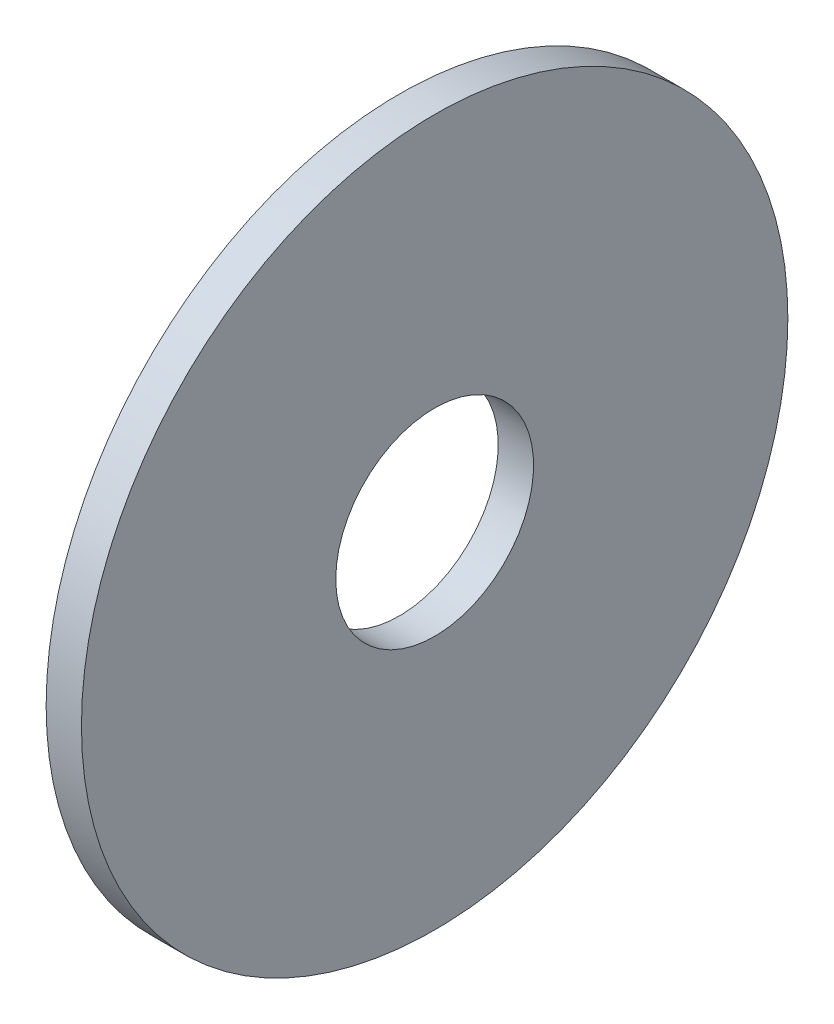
from build123d import *

# Parameters (mm, degrees)
ESQUISSE1_W = 1.5
ESQUISSE1_H = 10.8


with BuildPart() as part:
    # Esquisse1 → Base-R_volution (revolve)
    with BuildSketch(Plane(origin=(0, 0, 0), x_dir=(1, 0, 0), z_dir=(0, 1, 0)), mode=Mode.PRIVATE) as base_r_volution_sk:
        with Locations((0.75, 9.6)):
            Rectangle(ESQUISSE1_W, ESQUISSE1_H)
    revolve(base_r_volution_sk.sketch.rotate(Axis((0, 0, 0), (1, 0, 0)), 180), axis=Axis((0, 0, 0), (1, 0, 0)))


solid = part.part
